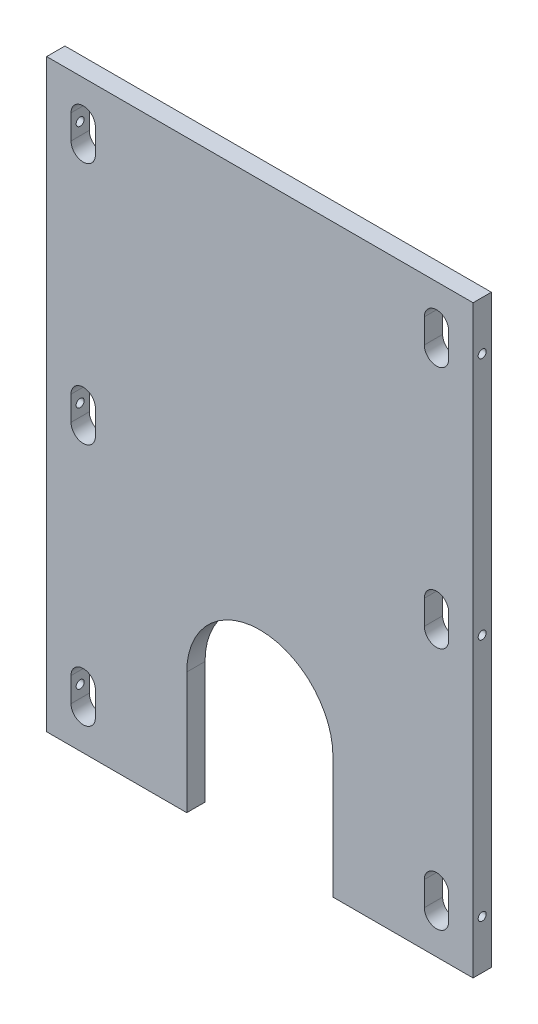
from build123d import *

# Parameters (mm, degrees)
SKETCH1_W                 = 444.5
SKETCH1_H                 = 609.6
EXTRUDE1_DEPTH            = 9.525
CUT_EXTRUDE2_DEPTH        = 378.704917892
LPATTERN2_COUNT           = 3
LPATTERN2_PITCH           = 254
MIRROR1_COPY_1_DEPTH      = 378.704917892
MIRROR1_COPY_2_DEPTH      = 378.704917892
CUT_EXTRUDE3_REACH        = 541.049
SKETCH4_R                 = 4.191
LPATTERN3_COUNT           = 3
LPATTERN3_PITCH           = 254
LPATTERN3_COPY_1_REACH    = 541.049
LPATTERN3_COPY_1_SKETCH_R = 4.191
LPATTERN3_COPY_2_REACH    = 541.049
LPATTERN3_COPY_2_SKETCH_R = 4.191
CUT_EXTRUDE4_DEPTH        = 378.704917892


with BuildPart() as part:
    # Sketch1 → Extrude1 (new, symmetric)
    with BuildSketch(Plane.XY):
        Rectangle(SKETCH1_W, SKETCH1_H)
    extrude(amount=EXTRUDE1_DEPTH, both=True)

    # Sketch3 → Cut-Extrude2 (cut, through all)
    with BuildSketch(Plane.XY.offset(9.525)):
        with BuildLine():
            Line((-171.45, 266.7), (-171.45, 241.3))
            ThreePointArc((-171.45, 241.3), (-184.15, 228.6), (-196.85, 241.3))
            Line((-196.85, 241.3), (-196.85, 266.7))
            ThreePointArc((-196.85, 266.7), (-184.15, 279.4), (-171.45, 266.7))
        make_face()
    cut_extrude2 = extrude(amount=-CUT_EXTRUDE2_DEPTH, mode=Mode.SUBTRACT)

    # LPattern2: Cut-Extrude2 ×3
    with Locations(*[(0, -i * LPATTERN2_PITCH, 0) for i in range(1, LPATTERN2_COUNT)]):
        add(cut_extrude2, mode=Mode.SUBTRACT)

    # Mirror1: Cut-Extrude2 across plane
    add(cut_extrude2.mirror(Plane(origin=(0, 0, 0), x_dir=(0, 0, 1), z_dir=(1, 0, 0))), mode=Mode.SUBTRACT)

    # Mirror1 copy 1 sketch → Mirror1 copy 1 (cut, through all)
    with BuildSketch(Plane(origin=(0, -254, 9.525), x_dir=(-1, 0, 0), z_dir=(0, 0, 1))):
        with BuildLine():
            Line((-171.45, -266.7), (-171.45, -241.3))
            ThreePointArc((-171.45, -241.3), (-184.15, -228.6), (-196.85, -241.3))
            Line((-196.85, -241.3), (-196.85, -266.7))
            ThreePointArc((-196.85, -266.7), (-184.15, -279.4), (-171.45, -266.7))
        make_face()
    extrude(amount=-MIRROR1_COPY_1_DEPTH, mode=Mode.SUBTRACT)

    # Mirror1 copy 2 sketch → Mirror1 copy 2 (cut, through all)
    with BuildSketch(Plane(origin=(0, -508, 9.525), x_dir=(-1, 0, 0), z_dir=(0, 0, 1))):
        with BuildLine():
            Line((-171.45, -266.7), (-171.45, -241.3))
            ThreePointArc((-171.45, -241.3), (-184.15, -228.6), (-196.85, -241.3))
            Line((-196.85, -241.3), (-196.85, -266.7))
            ThreePointArc((-196.85, -266.7), (-184.15, -279.4), (-171.45, -266.7))
        make_face()
    extrude(amount=-MIRROR1_COPY_2_DEPTH, mode=Mode.SUBTRACT)

    # Sketch4 → Cut-Extrude3 (cut, up to next)
    with BuildSketch(Plane.ZY.offset(222.25), mode=Mode.PRIVATE) as cut_extrude3_sk1:
        with Locations((0, 254)):
            Circle(SKETCH4_R)
    cut_extrude3_tool1 = extrude(cut_extrude3_sk1.sketch, amount=-CUT_EXTRUDE3_REACH, mode=Mode.PRIVATE) & part.part
    cut_extrude3 = cut_extrude3_tool1.solids().sort_by_distance((-222.25, 254, 0))[0]
    add(cut_extrude3, mode=Mode.SUBTRACT)

    # Mirror2: Cut-Extrude3 across plane
    add(cut_extrude3.mirror(Plane(origin=(0, 0, 0), x_dir=(0, 0, 1), z_dir=(1, 0, 0))), mode=Mode.SUBTRACT)

    # LPattern3: Cut-Extrude3 ×3
    with Locations(*[(0, -i * LPATTERN3_PITCH, 0) for i in range(1, LPATTERN3_COUNT)]):
        add(cut_extrude3, mode=Mode.SUBTRACT)

    # LPattern3 copy 1 sketch → LPattern3 copy 1 (cut, up to next)
    with BuildSketch(Plane(origin=(222.25, -254, 0), x_dir=(0, 0, 1), z_dir=(1, 0, 0)), mode=Mode.PRIVATE) as lpattern3_copy_1_sk1:
        with Locations((0, -254)):
            Circle(LPATTERN3_COPY_1_SKETCH_R)
    lpattern3_copy_1_tool1 = extrude(lpattern3_copy_1_sk1.sketch, amount=-LPATTERN3_COPY_1_REACH, mode=Mode.PRIVATE) & part.part
    add(lpattern3_copy_1_tool1.solids().sort_by_distance((222.25, 0, 0))[0], mode=Mode.SUBTRACT)

    # LPattern3 copy 2 sketch → LPattern3 copy 2 (cut, up to next)
    with BuildSketch(Plane(origin=(222.25, -508, 0), x_dir=(0, 0, 1), z_dir=(1, 0, 0)), mode=Mode.PRIVATE) as lpattern3_copy_2_sk1:
        with Locations((0, -254)):
            Circle(LPATTERN3_COPY_2_SKETCH_R)
    lpattern3_copy_2_tool1 = extrude(lpattern3_copy_2_sk1.sketch, amount=-LPATTERN3_COPY_2_REACH, mode=Mode.PRIVATE) & part.part
    add(lpattern3_copy_2_tool1.solids().sort_by_distance((222.25, -254, 0))[0], mode=Mode.SUBTRACT)

    # Sketch5 → Cut-Extrude4 (cut, through all)
    with BuildSketch(Plane.XY.offset(9.525)):
        with BuildLine():
            Line((76.2, -177.8), (76.2, -304.8))
            Line((76.2, -304.8), (-76.2, -304.8))
            Line((-76.2, -304.8), (-76.2, -177.8))
            ThreePointArc((-76.2, -177.8), (0, -101.6), (76.2, -177.8))
        make_face()
    extrude(amount=-CUT_EXTRUDE4_DEPTH, mode=Mode.SUBTRACT)


solid = part.part
